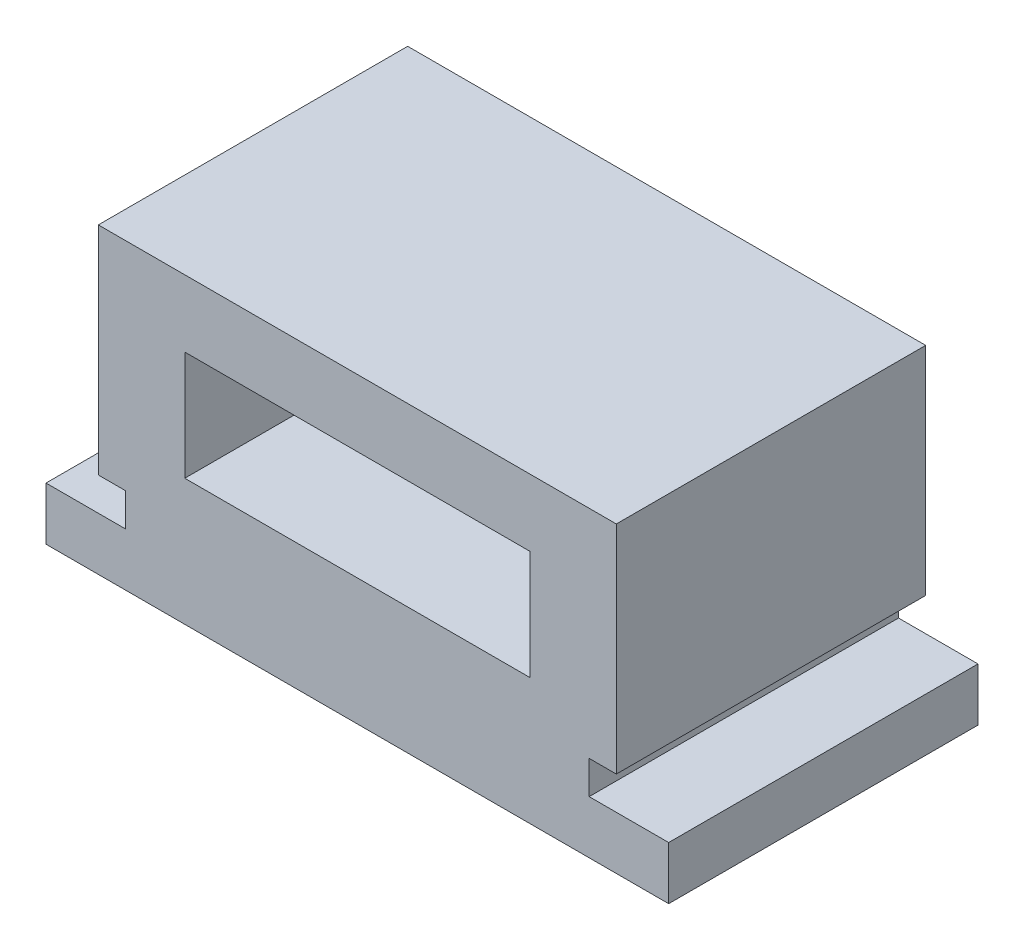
ISO-10303-21;
HEADER;
FILE_DESCRIPTION(('STEP AP214'),'2;1');
FILE_NAME('part.step','',(''),(''),'','','');
FILE_SCHEMA(('AUTOMOTIVE_DESIGN { 1 0 10303 214 1 1 1 1 }'));
ENDSEC;
DATA;
#1=APPLICATION_CONTEXT('core data for automotive mechanical design processes');
#2=APPLICATION_PROTOCOL_DEFINITION('international standard','automotive_design',2000,#1);
#3=PRODUCT_CONTEXT('',#1,'mechanical');
#4=PRODUCT('Part','Part','',(#3));
#5=PRODUCT_RELATED_PRODUCT_CATEGORY('part','',(#4));
#6=PRODUCT_DEFINITION_FORMATION('','',#4);
#7=PRODUCT_DEFINITION_CONTEXT('part definition',#1,'design');
#8=PRODUCT_DEFINITION('design','',#6,#7);
#9=PRODUCT_DEFINITION_SHAPE('','',#8);
#10=(LENGTH_UNIT() NAMED_UNIT(*) SI_UNIT(.MILLI.,.METRE.));
#11=(NAMED_UNIT(*) PLANE_ANGLE_UNIT() SI_UNIT($,.RADIAN.));
#12=(NAMED_UNIT(*) SI_UNIT($,.STERADIAN.) SOLID_ANGLE_UNIT());
#13=UNCERTAINTY_MEASURE_WITH_UNIT(LENGTH_MEASURE(1.E-05),#10,'distance_accuracy_value','');
#14=(GEOMETRIC_REPRESENTATION_CONTEXT(3) GLOBAL_UNCERTAINTY_ASSIGNED_CONTEXT((#13)) GLOBAL_UNIT_ASSIGNED_CONTEXT((#10,
#11,#12)) REPRESENTATION_CONTEXT('',''));
#15=CARTESIAN_POINT('',(0.,0.,0.));
#16=DIRECTION('',(0.,0.,1.));
#17=DIRECTION('',(1.,0.,0.));
#18=AXIS2_PLACEMENT_3D('',#15,#16,#17);
#19=CARTESIAN_POINT('',(-4.7,0.8,-4.67));
#20=DIRECTION('',(-1.,0.,0.));
#21=DIRECTION('',(0.,0.,1.));
#22=AXIS2_PLACEMENT_3D('',#19,#20,#21);
#23=PLANE('',#22);
#24=DIRECTION('',(0.,-1.,0.));
#25=VECTOR('',#24,1.);
#26=CARTESIAN_POINT('',(-4.7,0.8,0.));
#27=LINE('',#26,#25);
#28=CARTESIAN_POINT('',(-4.7,0.8,0.));
#29=VERTEX_POINT('',#28);
#30=CARTESIAN_POINT('',(-4.7,0.,0.));
#31=VERTEX_POINT('',#30);
#32=EDGE_CURVE('E197',#29,#31,#27,.T.);
#33=ORIENTED_EDGE('',*,*,#32,.F.);
#34=DIRECTION('',(0.,0.,1.));
#35=VECTOR('',#34,1.);
#36=CARTESIAN_POINT('',(-4.7,0.8,-4.67));
#37=LINE('',#36,#35);
#38=CARTESIAN_POINT('',(-4.7,0.8,-4.67));
#39=VERTEX_POINT('',#38);
#40=EDGE_CURVE('E11',#39,#29,#37,.T.);
#41=ORIENTED_EDGE('',*,*,#40,.F.);
#42=DIRECTION('',(0.,-1.,0.));
#43=VECTOR('',#42,1.);
#44=CARTESIAN_POINT('',(-4.7,0.8,-4.67));
#45=LINE('',#44,#43);
#46=CARTESIAN_POINT('',(-4.7,0.,-4.67));
#47=VERTEX_POINT('',#46);
#48=EDGE_CURVE('E203',#39,#47,#45,.T.);
#49=ORIENTED_EDGE('',*,*,#48,.T.);
#50=DIRECTION('',(0.,0.,1.));
#51=VECTOR('',#50,1.);
#52=CARTESIAN_POINT('',(-4.7,0.,-4.67));
#53=LINE('',#52,#51);
#54=EDGE_CURVE('E41',#47,#31,#53,.T.);
#55=ORIENTED_EDGE('',*,*,#54,.T.);
#56=EDGE_LOOP('',(#33,#41,#49,#55));
#57=FACE_BOUND('',#56,.T.);
#58=ADVANCED_FACE('F38',(#57),#23,.T.);
#59=CARTESIAN_POINT('',(-3.5,0.8,-4.67));
#60=DIRECTION('',(0.,1.,0.));
#61=DIRECTION('',(-1.,0.,0.));
#62=AXIS2_PLACEMENT_3D('',#59,#60,#61);
#63=PLANE('',#62);
#64=DIRECTION('',(-1.,0.,0.));
#65=VECTOR('',#64,1.);
#66=CARTESIAN_POINT('',(-3.5,0.8,0.));
#67=LINE('',#66,#65);
#68=CARTESIAN_POINT('',(-3.5,0.8,0.));
#69=VERTEX_POINT('',#68);
#70=EDGE_CURVE('E208',#69,#29,#67,.T.);
#71=ORIENTED_EDGE('',*,*,#70,.F.);
#72=DIRECTION('',(0.,0.,1.));
#73=VECTOR('',#72,1.);
#74=CARTESIAN_POINT('',(-3.5,0.8,-4.67));
#75=LINE('',#74,#73);
#76=CARTESIAN_POINT('',(-3.5,0.8,-4.67));
#77=VERTEX_POINT('',#76);
#78=EDGE_CURVE('E47',#77,#69,#75,.T.);
#79=ORIENTED_EDGE('',*,*,#78,.F.);
#80=DIRECTION('',(-1.,0.,0.));
#81=VECTOR('',#80,1.);
#82=CARTESIAN_POINT('',(-3.5,0.8,-4.67));
#83=LINE('',#82,#81);
#84=EDGE_CURVE('E247',#77,#39,#83,.T.);
#85=ORIENTED_EDGE('',*,*,#84,.T.);
#86=ORIENTED_EDGE('',*,*,#40,.T.);
#87=EDGE_LOOP('',(#71,#79,#85,#86));
#88=FACE_BOUND('',#87,.T.);
#89=ADVANCED_FACE('F337',(#88),#63,.T.);
#90=CARTESIAN_POINT('',(-3.5,1.3,-4.67));
#91=DIRECTION('',(-1.,0.,0.));
#92=DIRECTION('',(0.,-1.,0.));
#93=AXIS2_PLACEMENT_3D('',#90,#91,#92);
#94=PLANE('',#93);
#95=DIRECTION('',(0.,-1.,0.));
#96=VECTOR('',#95,1.);
#97=CARTESIAN_POINT('',(-3.5,1.3,0.));
#98=LINE('',#97,#96);
#99=CARTESIAN_POINT('',(-3.5,1.3,0.));
#100=VERTEX_POINT('',#99);
#101=EDGE_CURVE('E289',#100,#69,#98,.T.);
#102=ORIENTED_EDGE('',*,*,#101,.F.);
#103=DIRECTION('',(0.,0.,1.));
#104=VECTOR('',#103,1.);
#105=CARTESIAN_POINT('',(-3.5,1.3,-4.67));
#106=LINE('',#105,#104);
#107=CARTESIAN_POINT('',(-3.5,1.3,-4.67));
#108=VERTEX_POINT('',#107);
#109=EDGE_CURVE('E298',#108,#100,#106,.T.);
#110=ORIENTED_EDGE('',*,*,#109,.F.);
#111=DIRECTION('',(0.,-1.,0.));
#112=VECTOR('',#111,1.);
#113=CARTESIAN_POINT('',(-3.5,1.3,-4.67));
#114=LINE('',#113,#112);
#115=EDGE_CURVE('E243',#108,#77,#114,.T.);
#116=ORIENTED_EDGE('',*,*,#115,.T.);
#117=ORIENTED_EDGE('',*,*,#78,.T.);
#118=EDGE_LOOP('',(#102,#110,#116,#117));
#119=FACE_BOUND('',#118,.T.);
#120=ADVANCED_FACE('F372',(#119),#94,.T.);
#121=CARTESIAN_POINT('',(-3.91,1.3,-4.67));
#122=DIRECTION('',(0.,-1.,0.));
#123=DIRECTION('',(0.,0.,-1.));
#124=AXIS2_PLACEMENT_3D('',#121,#122,#123);
#125=PLANE('',#124);
#126=DIRECTION('',(1.,0.,0.));
#127=VECTOR('',#126,1.);
#128=CARTESIAN_POINT('',(-3.91,1.3,0.));
#129=LINE('',#128,#127);
#130=CARTESIAN_POINT('',(-3.91,1.3,0.));
#131=VERTEX_POINT('',#130);
#132=EDGE_CURVE('E285',#131,#100,#129,.T.);
#133=ORIENTED_EDGE('',*,*,#132,.F.);
#134=DIRECTION('',(0.,0.,1.));
#135=VECTOR('',#134,1.);
#136=CARTESIAN_POINT('',(-3.91,1.3,-4.67));
#137=LINE('',#136,#135);
#138=CARTESIAN_POINT('',(-3.91,1.3,-4.67));
#139=VERTEX_POINT('',#138);
#140=EDGE_CURVE('E301',#139,#131,#137,.T.);
#141=ORIENTED_EDGE('',*,*,#140,.F.);
#142=DIRECTION('',(1.,0.,0.));
#143=VECTOR('',#142,1.);
#144=CARTESIAN_POINT('',(-3.91,1.3,-4.67));
#145=LINE('',#144,#143);
#146=EDGE_CURVE('E239',#139,#108,#145,.T.);
#147=ORIENTED_EDGE('',*,*,#146,.T.);
#148=ORIENTED_EDGE('',*,*,#109,.T.);
#149=EDGE_LOOP('',(#133,#141,#147,#148));
#150=FACE_BOUND('',#149,.T.);
#151=ADVANCED_FACE('F369',(#150),#125,.T.);
#152=CARTESIAN_POINT('',(-3.91,4.57,-4.67));
#153=DIRECTION('',(-1.,0.,0.));
#154=DIRECTION('',(0.,0.,1.));
#155=AXIS2_PLACEMENT_3D('',#152,#153,#154);
#156=PLANE('',#155);
#157=DIRECTION('',(0.,-1.,0.));
#158=VECTOR('',#157,1.);
#159=CARTESIAN_POINT('',(-3.91,4.57,0.));
#160=LINE('',#159,#158);
#161=CARTESIAN_POINT('',(-3.91,4.57,0.));
#162=VERTEX_POINT('',#161);
#163=EDGE_CURVE('E281',#162,#131,#160,.T.);
#164=ORIENTED_EDGE('',*,*,#163,.F.);
#165=DIRECTION('',(0.,0.,1.));
#166=VECTOR('',#165,1.);
#167=CARTESIAN_POINT('',(-3.91,4.57,-4.67));
#168=LINE('',#167,#166);
#169=CARTESIAN_POINT('',(-3.91,4.57,-4.67));
#170=VERTEX_POINT('',#169);
#171=EDGE_CURVE('E304',#170,#162,#168,.T.);
#172=ORIENTED_EDGE('',*,*,#171,.F.);
#173=DIRECTION('',(0.,-1.,0.));
#174=VECTOR('',#173,1.);
#175=CARTESIAN_POINT('',(-3.91,4.57,-4.67));
#176=LINE('',#175,#174);
#177=EDGE_CURVE('E235',#170,#139,#176,.T.);
#178=ORIENTED_EDGE('',*,*,#177,.T.);
#179=ORIENTED_EDGE('',*,*,#140,.T.);
#180=EDGE_LOOP('',(#164,#172,#178,#179));
#181=FACE_BOUND('',#180,.T.);
#182=ADVANCED_FACE('F366',(#181),#156,.T.);
#183=CARTESIAN_POINT('',(3.91,4.57,-4.67));
#184=DIRECTION('',(0.,1.,0.));
#185=DIRECTION('',(-1.,0.,0.));
#186=AXIS2_PLACEMENT_3D('',#183,#184,#185);
#187=PLANE('',#186);
#188=DIRECTION('',(-1.,0.,0.));
#189=VECTOR('',#188,1.);
#190=CARTESIAN_POINT('',(3.91,4.57,0.));
#191=LINE('',#190,#189);
#192=CARTESIAN_POINT('',(3.91,4.57,0.));
#193=VERTEX_POINT('',#192);
#194=EDGE_CURVE('E277',#193,#162,#191,.T.);
#195=ORIENTED_EDGE('',*,*,#194,.F.);
#196=DIRECTION('',(0.,0.,1.));
#197=VECTOR('',#196,1.);
#198=CARTESIAN_POINT('',(3.91,4.57,-4.67));
#199=LINE('',#198,#197);
#200=CARTESIAN_POINT('',(3.91,4.57,-4.67));
#201=VERTEX_POINT('',#200);
#202=EDGE_CURVE('E307',#201,#193,#199,.T.);
#203=ORIENTED_EDGE('',*,*,#202,.F.);
#204=DIRECTION('',(-1.,0.,0.));
#205=VECTOR('',#204,1.);
#206=CARTESIAN_POINT('',(3.91,4.57,-4.67));
#207=LINE('',#206,#205);
#208=EDGE_CURVE('E231',#201,#170,#207,.T.);
#209=ORIENTED_EDGE('',*,*,#208,.T.);
#210=ORIENTED_EDGE('',*,*,#171,.T.);
#211=EDGE_LOOP('',(#195,#203,#209,#210));
#212=FACE_BOUND('',#211,.T.);
#213=ADVANCED_FACE('F362',(#212),#187,.T.);
#214=CARTESIAN_POINT('',(3.91,1.3,-4.67));
#215=DIRECTION('',(1.,0.,0.));
#216=DIRECTION('',(0.,0.,-1.));
#217=AXIS2_PLACEMENT_3D('',#214,#215,#216);
#218=PLANE('',#217);
#219=DIRECTION('',(0.,1.,0.));
#220=VECTOR('',#219,1.);
#221=CARTESIAN_POINT('',(3.91,1.3,0.));
#222=LINE('',#221,#220);
#223=CARTESIAN_POINT('',(3.91,1.3,0.));
#224=VERTEX_POINT('',#223);
#225=EDGE_CURVE('E273',#224,#193,#222,.T.);
#226=ORIENTED_EDGE('',*,*,#225,.F.);
#227=DIRECTION('',(0.,0.,1.));
#228=VECTOR('',#227,1.);
#229=CARTESIAN_POINT('',(3.91,1.3,-4.67));
#230=LINE('',#229,#228);
#231=CARTESIAN_POINT('',(3.91,1.3,-4.67));
#232=VERTEX_POINT('',#231);
#233=EDGE_CURVE('E310',#232,#224,#230,.T.);
#234=ORIENTED_EDGE('',*,*,#233,.F.);
#235=DIRECTION('',(0.,1.,0.));
#236=VECTOR('',#235,1.);
#237=CARTESIAN_POINT('',(3.91,1.3,-4.67));
#238=LINE('',#237,#236);
#239=EDGE_CURVE('E227',#232,#201,#238,.T.);
#240=ORIENTED_EDGE('',*,*,#239,.T.);
#241=ORIENTED_EDGE('',*,*,#202,.T.);
#242=EDGE_LOOP('',(#226,#234,#240,#241));
#243=FACE_BOUND('',#242,.T.);
#244=ADVANCED_FACE('F358',(#243),#218,.T.);
#245=CARTESIAN_POINT('',(3.5,1.3,-4.67));
#246=DIRECTION('',(0.,-1.,0.));
#247=DIRECTION('',(1.,0.,0.));
#248=AXIS2_PLACEMENT_3D('',#245,#246,#247);
#249=PLANE('',#248);
#250=DIRECTION('',(1.,0.,0.));
#251=VECTOR('',#250,1.);
#252=CARTESIAN_POINT('',(3.5,1.3,0.));
#253=LINE('',#252,#251);
#254=CARTESIAN_POINT('',(3.5,1.3,0.));
#255=VERTEX_POINT('',#254);
#256=EDGE_CURVE('E269',#255,#224,#253,.T.);
#257=ORIENTED_EDGE('',*,*,#256,.F.);
#258=DIRECTION('',(0.,0.,1.));
#259=VECTOR('',#258,1.);
#260=CARTESIAN_POINT('',(3.5,1.3,-4.67));
#261=LINE('',#260,#259);
#262=CARTESIAN_POINT('',(3.5,1.3,-4.67));
#263=VERTEX_POINT('',#262);
#264=EDGE_CURVE('E313',#263,#255,#261,.T.);
#265=ORIENTED_EDGE('',*,*,#264,.F.);
#266=DIRECTION('',(1.,0.,0.));
#267=VECTOR('',#266,1.);
#268=CARTESIAN_POINT('',(3.5,1.3,-4.67));
#269=LINE('',#268,#267);
#270=EDGE_CURVE('E223',#263,#232,#269,.T.);
#271=ORIENTED_EDGE('',*,*,#270,.T.);
#272=ORIENTED_EDGE('',*,*,#233,.T.);
#273=EDGE_LOOP('',(#257,#265,#271,#272));
#274=FACE_BOUND('',#273,.T.);
#275=ADVANCED_FACE('F354',(#274),#249,.T.);
#276=CARTESIAN_POINT('',(3.5,0.800000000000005,-4.67));
#277=DIRECTION('',(1.,0.,0.));
#278=DIRECTION('',(0.,1.,0.));
#279=AXIS2_PLACEMENT_3D('',#276,#277,#278);
#280=PLANE('',#279);
#281=DIRECTION('',(0.,1.,0.));
#282=VECTOR('',#281,1.);
#283=CARTESIAN_POINT('',(3.5,0.800000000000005,0.));
#284=LINE('',#283,#282);
#285=CARTESIAN_POINT('',(3.5,0.800000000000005,0.));
#286=VERTEX_POINT('',#285);
#287=EDGE_CURVE('E265',#286,#255,#284,.T.);
#288=ORIENTED_EDGE('',*,*,#287,.F.);
#289=DIRECTION('',(0.,0.,1.));
#290=VECTOR('',#289,1.);
#291=CARTESIAN_POINT('',(3.5,0.800000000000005,-4.67));
#292=LINE('',#291,#290);
#293=CARTESIAN_POINT('',(3.5,0.800000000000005,-4.67));
#294=VERTEX_POINT('',#293);
#295=EDGE_CURVE('E316',#294,#286,#292,.T.);
#296=ORIENTED_EDGE('',*,*,#295,.F.);
#297=DIRECTION('',(0.,1.,0.));
#298=VECTOR('',#297,1.);
#299=CARTESIAN_POINT('',(3.5,0.800000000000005,-4.67));
#300=LINE('',#299,#298);
#301=EDGE_CURVE('E219',#294,#263,#300,.T.);
#302=ORIENTED_EDGE('',*,*,#301,.T.);
#303=ORIENTED_EDGE('',*,*,#264,.T.);
#304=EDGE_LOOP('',(#288,#296,#302,#303));
#305=FACE_BOUND('',#304,.T.);
#306=ADVANCED_FACE('F350',(#305),#280,.T.);
#307=CARTESIAN_POINT('',(4.7,0.800000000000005,-4.67));
#308=DIRECTION('',(0.,1.,0.));
#309=DIRECTION('',(-1.,0.,0.));
#310=AXIS2_PLACEMENT_3D('',#307,#308,#309);
#311=PLANE('',#310);
#312=DIRECTION('',(-1.,0.,0.));
#313=VECTOR('',#312,1.);
#314=CARTESIAN_POINT('',(4.7,0.800000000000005,0.));
#315=LINE('',#314,#313);
#316=CARTESIAN_POINT('',(4.7,0.800000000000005,0.));
#317=VERTEX_POINT('',#316);
#318=EDGE_CURVE('E261',#317,#286,#315,.T.);
#319=ORIENTED_EDGE('',*,*,#318,.F.);
#320=DIRECTION('',(0.,0.,1.));
#321=VECTOR('',#320,1.);
#322=CARTESIAN_POINT('',(4.7,0.800000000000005,-4.67));
#323=LINE('',#322,#321);
#324=CARTESIAN_POINT('',(4.7,0.800000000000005,-4.67));
#325=VERTEX_POINT('',#324);
#326=EDGE_CURVE('E319',#325,#317,#323,.T.);
#327=ORIENTED_EDGE('',*,*,#326,.F.);
#328=DIRECTION('',(-1.,0.,0.));
#329=VECTOR('',#328,1.);
#330=CARTESIAN_POINT('',(4.7,0.800000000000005,-4.67));
#331=LINE('',#330,#329);
#332=EDGE_CURVE('E215',#325,#294,#331,.T.);
#333=ORIENTED_EDGE('',*,*,#332,.T.);
#334=ORIENTED_EDGE('',*,*,#295,.T.);
#335=EDGE_LOOP('',(#319,#327,#333,#334));
#336=FACE_BOUND('',#335,.T.);
#337=ADVANCED_FACE('F348',(#336),#311,.T.);
#338=CARTESIAN_POINT('',(4.7,0.,-4.67));
#339=DIRECTION('',(1.,0.,0.));
#340=DIRECTION('',(0.,0.,-1.));
#341=AXIS2_PLACEMENT_3D('',#338,#339,#340);
#342=PLANE('',#341);
#343=DIRECTION('',(0.,1.,0.));
#344=VECTOR('',#343,1.);
#345=CARTESIAN_POINT('',(4.7,0.,0.));
#346=LINE('',#345,#344);
#347=CARTESIAN_POINT('',(4.7,0.,0.));
#348=VERTEX_POINT('',#347);
#349=EDGE_CURVE('E257',#348,#317,#346,.T.);
#350=ORIENTED_EDGE('',*,*,#349,.F.);
#351=DIRECTION('',(0.,0.,1.));
#352=VECTOR('',#351,1.);
#353=CARTESIAN_POINT('',(4.7,0.,-4.67));
#354=LINE('',#353,#352);
#355=CARTESIAN_POINT('',(4.7,0.,-4.67));
#356=VERTEX_POINT('',#355);
#357=EDGE_CURVE('E321',#356,#348,#354,.T.);
#358=ORIENTED_EDGE('',*,*,#357,.F.);
#359=DIRECTION('',(0.,1.,0.));
#360=VECTOR('',#359,1.);
#361=CARTESIAN_POINT('',(4.7,0.,-4.67));
#362=LINE('',#361,#360);
#363=EDGE_CURVE('E211',#356,#325,#362,.T.);
#364=ORIENTED_EDGE('',*,*,#363,.T.);
#365=ORIENTED_EDGE('',*,*,#326,.T.);
#366=EDGE_LOOP('',(#350,#358,#364,#365));
#367=FACE_BOUND('',#366,.T.);
#368=ADVANCED_FACE('F344',(#367),#342,.T.);
#369=CARTESIAN_POINT('',(-4.7,0.,-4.67));
#370=DIRECTION('',(0.,-1.,0.));
#371=DIRECTION('',(0.,0.,-1.));
#372=AXIS2_PLACEMENT_3D('',#369,#370,#371);
#373=PLANE('',#372);
#374=DIRECTION('',(1.,0.,0.));
#375=VECTOR('',#374,1.);
#376=CARTESIAN_POINT('',(-4.7,0.,0.));
#377=LINE('',#376,#375);
#378=EDGE_CURVE('E253',#31,#348,#377,.T.);
#379=ORIENTED_EDGE('',*,*,#378,.F.);
#380=ORIENTED_EDGE('',*,*,#54,.F.);
#381=DIRECTION('',(1.,0.,0.));
#382=VECTOR('',#381,1.);
#383=CARTESIAN_POINT('',(-4.7,0.,-4.67));
#384=LINE('',#383,#382);
#385=EDGE_CURVE('E207',#47,#356,#384,.T.);
#386=ORIENTED_EDGE('',*,*,#385,.T.);
#387=ORIENTED_EDGE('',*,*,#357,.T.);
#388=EDGE_LOOP('',(#379,#380,#386,#387));
#389=FACE_BOUND('',#388,.T.);
#390=ADVANCED_FACE('F331',(#389),#373,.T.);
#391=CARTESIAN_POINT('',(0.,0.,-4.67));
#392=DIRECTION('',(0.,0.,1.));
#393=DIRECTION('',(1.,0.,0.));
#394=AXIS2_PLACEMENT_3D('',#391,#392,#393);
#395=PLANE('',#394);
#396=DIRECTION('',(1.,0.,0.));
#397=VECTOR('',#396,1.);
#398=CARTESIAN_POINT('',(-2.605,1.91,-4.67));
#399=LINE('',#398,#397);
#400=CARTESIAN_POINT('',(-2.605,1.91,-4.67));
#401=VERTEX_POINT('',#400);
#402=CARTESIAN_POINT('',(2.605,1.91,-4.67));
#403=VERTEX_POINT('',#402);
#404=EDGE_CURVE('E161',#401,#403,#399,.T.);
#405=ORIENTED_EDGE('',*,*,#404,.T.);
#406=DIRECTION('',(0.,1.,0.));
#407=VECTOR('',#406,1.);
#408=CARTESIAN_POINT('',(2.605,3.56,-4.67));
#409=LINE('',#408,#407);
#410=CARTESIAN_POINT('',(2.605,3.56,-4.67));
#411=VERTEX_POINT('',#410);
#412=EDGE_CURVE('E154',#403,#411,#409,.T.);
#413=ORIENTED_EDGE('',*,*,#412,.T.);
#414=DIRECTION('',(-1.,0.,0.));
#415=VECTOR('',#414,1.);
#416=CARTESIAN_POINT('',(-2.605,3.56,-4.67));
#417=LINE('',#416,#415);
#418=CARTESIAN_POINT('',(-2.605,3.56,-4.67));
#419=VERTEX_POINT('',#418);
#420=EDGE_CURVE('E164',#411,#419,#417,.T.);
#421=ORIENTED_EDGE('',*,*,#420,.T.);
#422=DIRECTION('',(0.,-1.,0.));
#423=VECTOR('',#422,1.);
#424=CARTESIAN_POINT('',(-2.605,3.56,-4.67));
#425=LINE('',#424,#423);
#426=EDGE_CURVE('E55',#419,#401,#425,.T.);
#427=ORIENTED_EDGE('',*,*,#426,.T.);
#428=EDGE_LOOP('',(#405,#413,#421,#427));
#429=FACE_BOUND('',#428,.T.);
#430=ORIENTED_EDGE('',*,*,#48,.F.);
#431=ORIENTED_EDGE('',*,*,#84,.F.);
#432=ORIENTED_EDGE('',*,*,#115,.F.);
#433=ORIENTED_EDGE('',*,*,#146,.F.);
#434=ORIENTED_EDGE('',*,*,#177,.F.);
#435=ORIENTED_EDGE('',*,*,#208,.F.);
#436=ORIENTED_EDGE('',*,*,#239,.F.);
#437=ORIENTED_EDGE('',*,*,#270,.F.);
#438=ORIENTED_EDGE('',*,*,#301,.F.);
#439=ORIENTED_EDGE('',*,*,#332,.F.);
#440=ORIENTED_EDGE('',*,*,#363,.F.);
#441=ORIENTED_EDGE('',*,*,#385,.F.);
#442=EDGE_LOOP('',(#430,#431,#432,#433,#434,#435,#436,#437,#438,#439,#440,#441));
#443=FACE_BOUND('',#442,.T.);
#444=ADVANCED_FACE('F169',(#429,#443),#395,.F.);
#445=CARTESIAN_POINT('',(0.,0.,0.));
#446=DIRECTION('',(0.,0.,1.));
#447=DIRECTION('',(1.,0.,0.));
#448=AXIS2_PLACEMENT_3D('',#445,#446,#447);
#449=PLANE('',#448);
#450=DIRECTION('',(0.,1.,0.));
#451=VECTOR('',#450,1.);
#452=CARTESIAN_POINT('',(2.605,3.56,0.));
#453=LINE('',#452,#451);
#454=CARTESIAN_POINT('',(2.605,1.91,0.));
#455=VERTEX_POINT('',#454);
#456=CARTESIAN_POINT('',(2.605,3.56,0.));
#457=VERTEX_POINT('',#456);
#458=EDGE_CURVE('E63',#455,#457,#453,.T.);
#459=ORIENTED_EDGE('',*,*,#458,.F.);
#460=DIRECTION('',(1.,0.,0.));
#461=VECTOR('',#460,1.);
#462=CARTESIAN_POINT('',(-2.605,1.91,0.));
#463=LINE('',#462,#461);
#464=CARTESIAN_POINT('',(-2.605,1.91,0.));
#465=VERTEX_POINT('',#464);
#466=EDGE_CURVE('E173',#465,#455,#463,.T.);
#467=ORIENTED_EDGE('',*,*,#466,.F.);
#468=DIRECTION('',(0.,-1.,0.));
#469=VECTOR('',#468,1.);
#470=CARTESIAN_POINT('',(-2.605,3.56,0.));
#471=LINE('',#470,#469);
#472=CARTESIAN_POINT('',(-2.605,3.56,0.));
#473=VERTEX_POINT('',#472);
#474=EDGE_CURVE('E179',#473,#465,#471,.T.);
#475=ORIENTED_EDGE('',*,*,#474,.F.);
#476=DIRECTION('',(-1.,0.,0.));
#477=VECTOR('',#476,1.);
#478=CARTESIAN_POINT('',(-2.605,3.56,0.));
#479=LINE('',#478,#477);
#480=EDGE_CURVE('E188',#457,#473,#479,.T.);
#481=ORIENTED_EDGE('',*,*,#480,.F.);
#482=EDGE_LOOP('',(#459,#467,#475,#481));
#483=FACE_BOUND('',#482,.T.);
#484=ORIENTED_EDGE('',*,*,#32,.T.);
#485=ORIENTED_EDGE('',*,*,#378,.T.);
#486=ORIENTED_EDGE('',*,*,#349,.T.);
#487=ORIENTED_EDGE('',*,*,#318,.T.);
#488=ORIENTED_EDGE('',*,*,#287,.T.);
#489=ORIENTED_EDGE('',*,*,#256,.T.);
#490=ORIENTED_EDGE('',*,*,#225,.T.);
#491=ORIENTED_EDGE('',*,*,#194,.T.);
#492=ORIENTED_EDGE('',*,*,#163,.T.);
#493=ORIENTED_EDGE('',*,*,#132,.T.);
#494=ORIENTED_EDGE('',*,*,#101,.T.);
#495=ORIENTED_EDGE('',*,*,#70,.T.);
#496=EDGE_LOOP('',(#484,#485,#486,#487,#488,#489,#490,#491,#492,#493,#494,#495));
#497=FACE_BOUND('',#496,.T.);
#498=ADVANCED_FACE('F333',(#483,#497),#449,.T.);
#499=CARTESIAN_POINT('',(2.605,3.56,-4.67));
#500=DIRECTION('',(1.,0.,0.));
#501=DIRECTION('',(0.,0.,-1.));
#502=AXIS2_PLACEMENT_3D('',#499,#500,#501);
#503=PLANE('',#502);
#504=ORIENTED_EDGE('',*,*,#458,.T.);
#505=DIRECTION('',(0.,0.,1.));
#506=VECTOR('',#505,1.);
#507=CARTESIAN_POINT('',(2.605,3.56,-4.67));
#508=LINE('',#507,#506);
#509=EDGE_CURVE('E150',#411,#457,#508,.T.);
#510=ORIENTED_EDGE('',*,*,#509,.F.);
#511=ORIENTED_EDGE('',*,*,#412,.F.);
#512=DIRECTION('',(0.,0.,1.));
#513=VECTOR('',#512,1.);
#514=CARTESIAN_POINT('',(2.605,1.91,-4.67));
#515=LINE('',#514,#513);
#516=EDGE_CURVE('E194',#403,#455,#515,.T.);
#517=ORIENTED_EDGE('',*,*,#516,.T.);
#518=EDGE_LOOP('',(#504,#510,#511,#517));
#519=FACE_BOUND('',#518,.T.);
#520=ADVANCED_FACE('F152',(#519),#503,.F.);
#521=CARTESIAN_POINT('',(-2.605,1.91,-4.67));
#522=DIRECTION('',(0.,-1.,0.));
#523=DIRECTION('',(1.,0.,0.));
#524=AXIS2_PLACEMENT_3D('',#521,#522,#523);
#525=PLANE('',#524);
#526=ORIENTED_EDGE('',*,*,#466,.T.);
#527=ORIENTED_EDGE('',*,*,#516,.F.);
#528=ORIENTED_EDGE('',*,*,#404,.F.);
#529=DIRECTION('',(0.,0.,1.));
#530=VECTOR('',#529,1.);
#531=CARTESIAN_POINT('',(-2.605,1.91,-4.67));
#532=LINE('',#531,#530);
#533=EDGE_CURVE('E198',#401,#465,#532,.T.);
#534=ORIENTED_EDGE('',*,*,#533,.T.);
#535=EDGE_LOOP('',(#526,#527,#528,#534));
#536=FACE_BOUND('',#535,.T.);
#537=ADVANCED_FACE('F472',(#536),#525,.F.);
#538=CARTESIAN_POINT('',(-2.605,3.56,-4.67));
#539=DIRECTION('',(-1.,0.,0.));
#540=DIRECTION('',(0.,-1.,0.));
#541=AXIS2_PLACEMENT_3D('',#538,#539,#540);
#542=PLANE('',#541);
#543=ORIENTED_EDGE('',*,*,#474,.T.);
#544=ORIENTED_EDGE('',*,*,#533,.F.);
#545=ORIENTED_EDGE('',*,*,#426,.F.);
#546=DIRECTION('',(0.,0.,1.));
#547=VECTOR('',#546,1.);
#548=CARTESIAN_POINT('',(-2.605,3.56,-4.67));
#549=LINE('',#548,#547);
#550=EDGE_CURVE('E160',#419,#473,#549,.T.);
#551=ORIENTED_EDGE('',*,*,#550,.T.);
#552=EDGE_LOOP('',(#543,#544,#545,#551));
#553=FACE_BOUND('',#552,.T.);
#554=ADVANCED_FACE('F480',(#553),#542,.F.);
#555=CARTESIAN_POINT('',(-2.605,3.56,-4.67));
#556=DIRECTION('',(0.,1.,0.));
#557=DIRECTION('',(0.,0.,1.));
#558=AXIS2_PLACEMENT_3D('',#555,#556,#557);
#559=PLANE('',#558);
#560=ORIENTED_EDGE('',*,*,#480,.T.);
#561=ORIENTED_EDGE('',*,*,#550,.F.);
#562=ORIENTED_EDGE('',*,*,#420,.F.);
#563=ORIENTED_EDGE('',*,*,#509,.T.);
#564=EDGE_LOOP('',(#560,#561,#562,#563));
#565=FACE_BOUND('',#564,.T.);
#566=ADVANCED_FACE('F165',(#565),#559,.F.);
#567=CLOSED_SHELL('',(#58,#89,#120,#151,#182,#213,#244,#275,#306,#337,#368,#390,#444,#498,#520,
#537,#554,#566));
#568=MANIFOLD_SOLID_BREP('B2',#567);
#569=ADVANCED_BREP_SHAPE_REPRESENTATION('',(#18,#568),#14);
#570=SHAPE_DEFINITION_REPRESENTATION(#9,#569);
ENDSEC;
END-ISO-10303-21;
